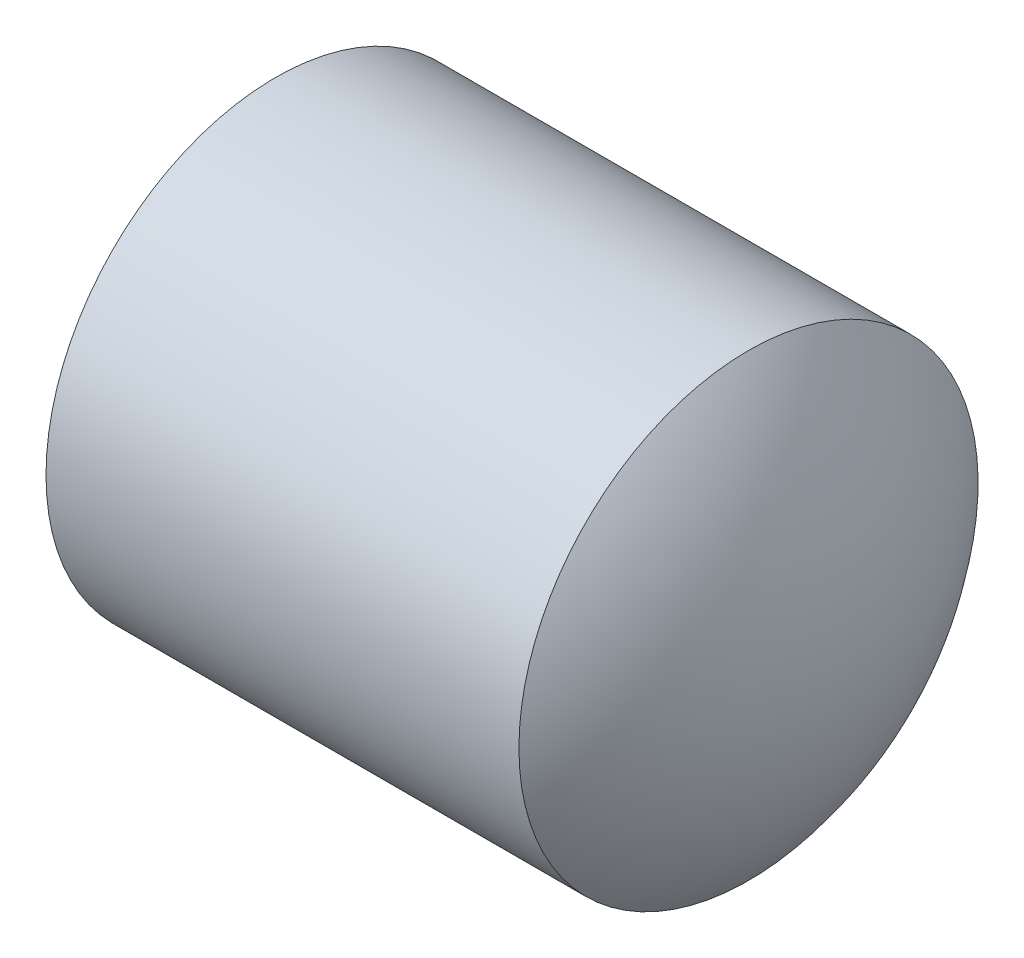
ISO-10303-21;
HEADER;
FILE_DESCRIPTION(('STEP AP214'),'2;1');
FILE_NAME('part.step','',(''),(''),'','','');
FILE_SCHEMA(('AUTOMOTIVE_DESIGN { 1 0 10303 214 1 1 1 1 }'));
ENDSEC;
DATA;
#1=APPLICATION_CONTEXT('core data for automotive mechanical design processes');
#2=APPLICATION_PROTOCOL_DEFINITION('international standard','automotive_design',2000,#1);
#3=PRODUCT_CONTEXT('',#1,'mechanical');
#4=PRODUCT('Part','Part','',(#3));
#5=PRODUCT_RELATED_PRODUCT_CATEGORY('part','',(#4));
#6=PRODUCT_DEFINITION_FORMATION('','',#4);
#7=PRODUCT_DEFINITION_CONTEXT('part definition',#1,'design');
#8=PRODUCT_DEFINITION('design','',#6,#7);
#9=PRODUCT_DEFINITION_SHAPE('','',#8);
#10=(LENGTH_UNIT() NAMED_UNIT(*) SI_UNIT(.MILLI.,.METRE.));
#11=(NAMED_UNIT(*) PLANE_ANGLE_UNIT() SI_UNIT($,.RADIAN.));
#12=(NAMED_UNIT(*) SI_UNIT($,.STERADIAN.) SOLID_ANGLE_UNIT());
#13=UNCERTAINTY_MEASURE_WITH_UNIT(LENGTH_MEASURE(1.E-05),#10,'distance_accuracy_value','');
#14=(GEOMETRIC_REPRESENTATION_CONTEXT(3) GLOBAL_UNCERTAINTY_ASSIGNED_CONTEXT((#13)) GLOBAL_UNIT_ASSIGNED_CONTEXT((#10,
#11,#12)) REPRESENTATION_CONTEXT('',''));
#15=CARTESIAN_POINT('',(0.,0.,0.));
#16=DIRECTION('',(0.,0.,1.));
#17=DIRECTION('',(1.,0.,0.));
#18=AXIS2_PLACEMENT_3D('',#15,#16,#17);
#19=CARTESIAN_POINT('',(0.,0.,0.));
#20=DIRECTION('',(-1.,0.,0.));
#21=DIRECTION('',(0.,0.,1.));
#22=AXIS2_PLACEMENT_3D('',#19,#20,#21);
#23=PLANE('',#22);
#24=CARTESIAN_POINT('',(0.,0.,0.));
#25=DIRECTION('',(-1.,0.,0.));
#26=DIRECTION('',(0.,0.,1.));
#27=AXIS2_PLACEMENT_3D('',#24,#25,#26);
#28=CIRCLE('',#27,10.352);
#29=CARTESIAN_POINT('',(0.,0.,10.352));
#30=VERTEX_POINT('',#29);
#31=EDGE_CURVE('E141',#30,#30,#28,.T.);
#32=ORIENTED_EDGE('',*,*,#31,.T.);
#33=EDGE_LOOP('',(#32));
#34=FACE_BOUND('',#33,.T.);
#35=DIRECTION('',(0.,0.,-1.));
#36=VECTOR('',#35,1.);
#37=CARTESIAN_POINT('',(0.,6.,3.46410161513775));
#38=LINE('',#37,#36);
#39=CARTESIAN_POINT('',(0.,6.,3.46410161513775));
#40=VERTEX_POINT('',#39);
#41=CARTESIAN_POINT('',(0.,6.,-3.46410161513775));
#42=VERTEX_POINT('',#41);
#43=EDGE_CURVE('E132',#40,#42,#38,.T.);
#44=ORIENTED_EDGE('',*,*,#43,.F.);
#45=DIRECTION('',(0.,-0.866025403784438,0.5));
#46=VECTOR('',#45,1.);
#47=CARTESIAN_POINT('',(0.,6.,3.46410161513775));
#48=LINE('',#47,#46);
#49=CARTESIAN_POINT('',(0.,0.,6.92820323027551));
#50=VERTEX_POINT('',#49);
#51=EDGE_CURVE('E57',#40,#50,#48,.T.);
#52=ORIENTED_EDGE('',*,*,#51,.T.);
#53=DIRECTION('',(0.,0.866025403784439,0.5));
#54=VECTOR('',#53,1.);
#55=CARTESIAN_POINT('',(0.,-5.99999999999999,3.46410161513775));
#56=LINE('',#55,#54);
#57=CARTESIAN_POINT('',(0.,-5.99999999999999,3.46410161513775));
#58=VERTEX_POINT('',#57);
#59=EDGE_CURVE('E123',#58,#50,#56,.T.);
#60=ORIENTED_EDGE('',*,*,#59,.F.);
#61=DIRECTION('',(0.,0.,-1.));
#62=VECTOR('',#61,1.);
#63=CARTESIAN_POINT('',(0.,-5.99999999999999,3.46410161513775));
#64=LINE('',#63,#62);
#65=CARTESIAN_POINT('',(0.,-5.99999999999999,-3.46410161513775));
#66=VERTEX_POINT('',#65);
#67=EDGE_CURVE('E130',#58,#66,#64,.T.);
#68=ORIENTED_EDGE('',*,*,#67,.T.);
#69=DIRECTION('',(0.,0.866025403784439,-0.5));
#70=VECTOR('',#69,1.);
#71=CARTESIAN_POINT('',(0.,-5.99999999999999,-3.46410161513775));
#72=LINE('',#71,#70);
#73=CARTESIAN_POINT('',(0.,0.,-6.92820323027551));
#74=VERTEX_POINT('',#73);
#75=EDGE_CURVE('E133',#66,#74,#72,.T.);
#76=ORIENTED_EDGE('',*,*,#75,.T.);
#77=DIRECTION('',(0.,-0.866025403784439,-0.5));
#78=VECTOR('',#77,1.);
#79=CARTESIAN_POINT('',(0.,6.,-3.46410161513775));
#80=LINE('',#79,#78);
#81=EDGE_CURVE('E112',#42,#74,#80,.T.);
#82=ORIENTED_EDGE('',*,*,#81,.F.);
#83=EDGE_LOOP('',(#44,#52,#60,#68,#76,#82));
#84=FACE_BOUND('',#83,.T.);
#85=ADVANCED_FACE('F41',(#34,#84),#23,.T.);
#86=CARTESIAN_POINT('',(11.2,0.,0.));
#87=DIRECTION('',(-1.,0.,0.));
#88=DIRECTION('',(0.,1.,0.));
#89=AXIS2_PLACEMENT_3D('',#86,#87,#88);
#90=SPHERICAL_SURFACE('',#89,18.8);
#91=CARTESIAN_POINT('',(25.6720420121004,0.,0.));
#92=DIRECTION('',(-1.,0.,0.));
#93=DIRECTION('',(0.,0.,1.));
#94=AXIS2_PLACEMENT_3D('',#91,#92,#93);
#95=CIRCLE('',#94,12.);
#96=CARTESIAN_POINT('',(25.6720420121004,0.,12.));
#97=VERTEX_POINT('',#96);
#98=EDGE_CURVE('E11',#97,#97,#95,.T.);
#99=ORIENTED_EDGE('',*,*,#98,.F.);
#100=EDGE_LOOP('',(#99));
#101=FACE_BOUND('',#100,.T.);
#102=ADVANCED_FACE('F43',(#101),#90,.T.);
#103=CARTESIAN_POINT('',(-12.7,0.,0.));
#104=DIRECTION('',(-1.,0.,0.));
#105=DIRECTION('',(0.,0.,1.));
#106=AXIS2_PLACEMENT_3D('',#103,#104,#105);
#107=CYLINDRICAL_SURFACE('',#106,12.);
#108=ORIENTED_EDGE('',*,*,#98,.T.);
#109=EDGE_LOOP('',(#108));
#110=FACE_BOUND('',#109,.T.);
#111=CARTESIAN_POINT('',(0.951473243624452,0.,0.));
#112=DIRECTION('',(-1.,0.,0.));
#113=DIRECTION('',(0.,0.,1.));
#114=AXIS2_PLACEMENT_3D('',#111,#112,#113);
#115=CIRCLE('',#114,12.);
#116=CARTESIAN_POINT('',(0.951473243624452,0.,12.));
#117=VERTEX_POINT('',#116);
#118=EDGE_CURVE('E47',#117,#117,#115,.T.);
#119=ORIENTED_EDGE('',*,*,#118,.F.);
#120=EDGE_LOOP('',(#119));
#121=FACE_BOUND('',#120,.T.);
#122=ADVANCED_FACE('F153',(#110,#121),#107,.T.);
#123=CARTESIAN_POINT('',(0.,0.,0.));
#124=DIRECTION('',(1.,0.,0.));
#125=DIRECTION('',(0.,0.,-1.));
#126=AXIS2_PLACEMENT_3D('',#123,#124,#125);
#127=CONICAL_SURFACE('',#126,10.352,1.04719755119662);
#128=ORIENTED_EDGE('',*,*,#118,.T.);
#129=EDGE_LOOP('',(#128));
#130=FACE_BOUND('',#129,.T.);
#131=ORIENTED_EDGE('',*,*,#31,.F.);
#132=EDGE_LOOP('',(#131));
#133=FACE_BOUND('',#132,.T.);
#134=ADVANCED_FACE('F150',(#130,#133),#127,.T.);
#135=CARTESIAN_POINT('',(12.,6.,3.46410161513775));
#136=DIRECTION('',(0.,-0.5,-0.866025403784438));
#137=DIRECTION('',(0.,0.866025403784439,-0.5));
#138=AXIS2_PLACEMENT_3D('',#135,#136,#137);
#139=PLANE('',#138);
#140=ORIENTED_EDGE('',*,*,#51,.F.);
#141=DIRECTION('',(-1.,0.,0.));
#142=VECTOR('',#141,1.);
#143=CARTESIAN_POINT('',(12.,6.,3.46410161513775));
#144=LINE('',#143,#142);
#145=CARTESIAN_POINT('',(12.,6.,3.46410161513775));
#146=VERTEX_POINT('',#145);
#147=EDGE_CURVE('E64',#146,#40,#144,.T.);
#148=ORIENTED_EDGE('',*,*,#147,.F.);
#149=DIRECTION('',(0.,-0.866025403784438,0.5));
#150=VECTOR('',#149,1.);
#151=CARTESIAN_POINT('',(12.,6.,3.46410161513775));
#152=LINE('',#151,#150);
#153=CARTESIAN_POINT('',(12.,0.,6.92820323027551));
#154=VERTEX_POINT('',#153);
#155=EDGE_CURVE('E86',#146,#154,#152,.T.);
#156=ORIENTED_EDGE('',*,*,#155,.T.);
#157=DIRECTION('',(-1.,0.,0.));
#158=VECTOR('',#157,1.);
#159=CARTESIAN_POINT('',(12.,0.,6.92820323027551));
#160=LINE('',#159,#158);
#161=EDGE_CURVE('E142',#154,#50,#160,.T.);
#162=ORIENTED_EDGE('',*,*,#161,.T.);
#163=EDGE_LOOP('',(#140,#148,#156,#162));
#164=FACE_BOUND('',#163,.T.);
#165=ADVANCED_FACE('F157',(#164),#139,.T.);
#166=CARTESIAN_POINT('',(12.,-5.99999999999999,3.46410161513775));
#167=DIRECTION('',(0.,-0.5,0.866025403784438));
#168=DIRECTION('',(0.,-0.866025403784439,-0.5));
#169=AXIS2_PLACEMENT_3D('',#166,#167,#168);
#170=PLANE('',#169);
#171=ORIENTED_EDGE('',*,*,#59,.T.);
#172=ORIENTED_EDGE('',*,*,#161,.F.);
#173=DIRECTION('',(0.,0.866025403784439,0.5));
#174=VECTOR('',#173,1.);
#175=CARTESIAN_POINT('',(12.,-5.99999999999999,3.46410161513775));
#176=LINE('',#175,#174);
#177=CARTESIAN_POINT('',(12.,-5.99999999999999,3.46410161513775));
#178=VERTEX_POINT('',#177);
#179=EDGE_CURVE('E259',#178,#154,#176,.T.);
#180=ORIENTED_EDGE('',*,*,#179,.F.);
#181=DIRECTION('',(-1.,0.,0.));
#182=VECTOR('',#181,1.);
#183=CARTESIAN_POINT('',(12.,-5.99999999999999,3.46410161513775));
#184=LINE('',#183,#182);
#185=EDGE_CURVE('E138',#178,#58,#184,.T.);
#186=ORIENTED_EDGE('',*,*,#185,.T.);
#187=EDGE_LOOP('',(#171,#172,#180,#186));
#188=FACE_BOUND('',#187,.T.);
#189=ADVANCED_FACE('F167',(#188),#170,.F.);
#190=CARTESIAN_POINT('',(12.,-5.99999999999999,3.46410161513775));
#191=DIRECTION('',(0.,1.,0.));
#192=DIRECTION('',(0.,0.,1.));
#193=AXIS2_PLACEMENT_3D('',#190,#191,#192);
#194=PLANE('',#193);
#195=ORIENTED_EDGE('',*,*,#67,.F.);
#196=ORIENTED_EDGE('',*,*,#185,.F.);
#197=DIRECTION('',(0.,0.,-1.));
#198=VECTOR('',#197,1.);
#199=CARTESIAN_POINT('',(12.,-5.99999999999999,3.46410161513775));
#200=LINE('',#199,#198);
#201=CARTESIAN_POINT('',(12.,-5.99999999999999,-3.46410161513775));
#202=VERTEX_POINT('',#201);
#203=EDGE_CURVE('E107',#178,#202,#200,.T.);
#204=ORIENTED_EDGE('',*,*,#203,.T.);
#205=DIRECTION('',(-1.,0.,0.));
#206=VECTOR('',#205,1.);
#207=CARTESIAN_POINT('',(12.,-5.99999999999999,-3.46410161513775));
#208=LINE('',#207,#206);
#209=EDGE_CURVE('E104',#202,#66,#208,.T.);
#210=ORIENTED_EDGE('',*,*,#209,.T.);
#211=EDGE_LOOP('',(#195,#196,#204,#210));
#212=FACE_BOUND('',#211,.T.);
#213=ADVANCED_FACE('F173',(#212),#194,.T.);
#214=CARTESIAN_POINT('',(12.,-5.99999999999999,-3.46410161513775));
#215=DIRECTION('',(0.,0.5,0.866025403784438));
#216=DIRECTION('',(0.,-0.866025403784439,0.5));
#217=AXIS2_PLACEMENT_3D('',#214,#215,#216);
#218=PLANE('',#217);
#219=ORIENTED_EDGE('',*,*,#75,.F.);
#220=ORIENTED_EDGE('',*,*,#209,.F.);
#221=DIRECTION('',(0.,0.866025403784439,-0.5));
#222=VECTOR('',#221,1.);
#223=CARTESIAN_POINT('',(12.,-5.99999999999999,-3.46410161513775));
#224=LINE('',#223,#222);
#225=CARTESIAN_POINT('',(12.,0.,-6.92820323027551));
#226=VERTEX_POINT('',#225);
#227=EDGE_CURVE('E100',#202,#226,#224,.T.);
#228=ORIENTED_EDGE('',*,*,#227,.T.);
#229=DIRECTION('',(-1.,0.,0.));
#230=VECTOR('',#229,1.);
#231=CARTESIAN_POINT('',(12.,0.,-6.92820323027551));
#232=LINE('',#231,#230);
#233=EDGE_CURVE('E101',#226,#74,#232,.T.);
#234=ORIENTED_EDGE('',*,*,#233,.T.);
#235=EDGE_LOOP('',(#219,#220,#228,#234));
#236=FACE_BOUND('',#235,.T.);
#237=ADVANCED_FACE('F105',(#236),#218,.T.);
#238=CARTESIAN_POINT('',(12.,6.,-3.46410161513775));
#239=DIRECTION('',(0.,0.5,-0.866025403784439));
#240=DIRECTION('',(0.,0.866025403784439,0.5));
#241=AXIS2_PLACEMENT_3D('',#238,#239,#240);
#242=PLANE('',#241);
#243=ORIENTED_EDGE('',*,*,#81,.T.);
#244=ORIENTED_EDGE('',*,*,#233,.F.);
#245=DIRECTION('',(0.,-0.866025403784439,-0.5));
#246=VECTOR('',#245,1.);
#247=CARTESIAN_POINT('',(12.,6.,-3.46410161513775));
#248=LINE('',#247,#246);
#249=CARTESIAN_POINT('',(12.,6.,-3.46410161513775));
#250=VERTEX_POINT('',#249);
#251=EDGE_CURVE('E108',#250,#226,#248,.T.);
#252=ORIENTED_EDGE('',*,*,#251,.F.);
#253=DIRECTION('',(-1.,0.,0.));
#254=VECTOR('',#253,1.);
#255=CARTESIAN_POINT('',(12.,6.,-3.46410161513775));
#256=LINE('',#255,#254);
#257=EDGE_CURVE('E83',#250,#42,#256,.T.);
#258=ORIENTED_EDGE('',*,*,#257,.T.);
#259=EDGE_LOOP('',(#243,#244,#252,#258));
#260=FACE_BOUND('',#259,.T.);
#261=ADVANCED_FACE('F111',(#260),#242,.F.);
#262=CARTESIAN_POINT('',(12.,6.,3.46410161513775));
#263=DIRECTION('',(0.,1.,0.));
#264=DIRECTION('',(0.,0.,1.));
#265=AXIS2_PLACEMENT_3D('',#262,#263,#264);
#266=PLANE('',#265);
#267=ORIENTED_EDGE('',*,*,#43,.T.);
#268=ORIENTED_EDGE('',*,*,#257,.F.);
#269=DIRECTION('',(0.,0.,-1.));
#270=VECTOR('',#269,1.);
#271=CARTESIAN_POINT('',(12.,6.,3.46410161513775));
#272=LINE('',#271,#270);
#273=EDGE_CURVE('E118',#146,#250,#272,.T.);
#274=ORIENTED_EDGE('',*,*,#273,.F.);
#275=ORIENTED_EDGE('',*,*,#147,.T.);
#276=EDGE_LOOP('',(#267,#268,#274,#275));
#277=FACE_BOUND('',#276,.T.);
#278=ADVANCED_FACE('F185',(#277),#266,.F.);
#279=CARTESIAN_POINT('',(12.,0.,6.92820323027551));
#280=DIRECTION('',(-1.,0.,0.));
#281=DIRECTION('',(0.,0.,1.));
#282=AXIS2_PLACEMENT_3D('',#279,#280,#281);
#283=PLANE('',#282);
#284=ORIENTED_EDGE('',*,*,#155,.F.);
#285=ORIENTED_EDGE('',*,*,#273,.T.);
#286=ORIENTED_EDGE('',*,*,#251,.T.);
#287=ORIENTED_EDGE('',*,*,#227,.F.);
#288=ORIENTED_EDGE('',*,*,#203,.F.);
#289=ORIENTED_EDGE('',*,*,#179,.T.);
#290=EDGE_LOOP('',(#284,#285,#286,#287,#288,#289));
#291=FACE_BOUND('',#290,.T.);
#292=ADVANCED_FACE('F120',(#291),#283,.T.);
#293=CLOSED_SHELL('',(#85,#102,#122,#134,#165,#189,#213,#237,#261,#278,#292));
#294=MANIFOLD_SOLID_BREP('B2',#293);
#295=ADVANCED_BREP_SHAPE_REPRESENTATION('',(#18,#294),#14);
#296=SHAPE_DEFINITION_REPRESENTATION(#9,#295);
ENDSEC;
END-ISO-10303-21;
